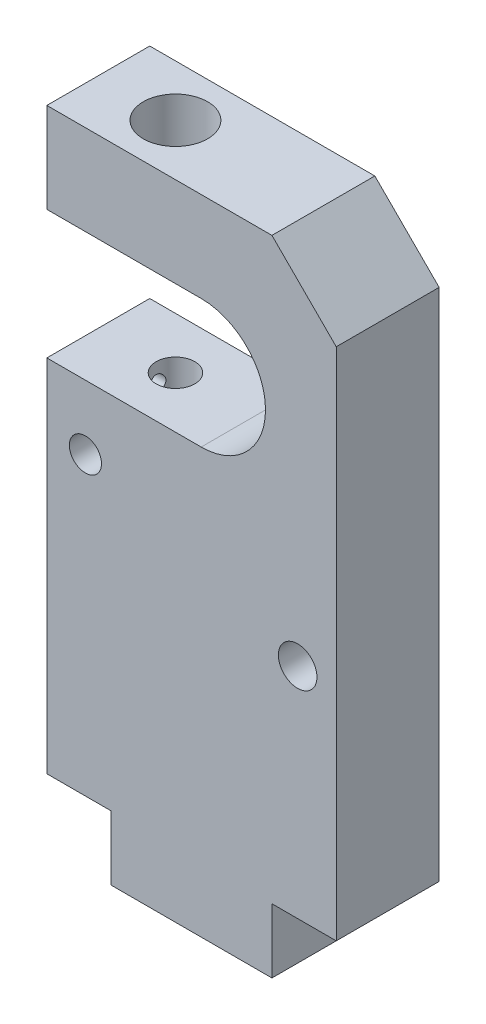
ISO-10303-21;
HEADER;
FILE_DESCRIPTION(('STEP AP214'),'2;1');
FILE_NAME('part.step','',(''),(''),'','','');
FILE_SCHEMA(('AUTOMOTIVE_DESIGN { 1 0 10303 214 1 1 1 1 }'));
ENDSEC;
DATA;
#1=APPLICATION_CONTEXT('core data for automotive mechanical design processes');
#2=APPLICATION_PROTOCOL_DEFINITION('international standard','automotive_design',2000,#1);
#3=PRODUCT_CONTEXT('',#1,'mechanical');
#4=PRODUCT('Part','Part','',(#3));
#5=PRODUCT_RELATED_PRODUCT_CATEGORY('part','',(#4));
#6=PRODUCT_DEFINITION_FORMATION('','',#4);
#7=PRODUCT_DEFINITION_CONTEXT('part definition',#1,'design');
#8=PRODUCT_DEFINITION('design','',#6,#7);
#9=PRODUCT_DEFINITION_SHAPE('','',#8);
#10=(LENGTH_UNIT() NAMED_UNIT(*) SI_UNIT(.MILLI.,.METRE.));
#11=(NAMED_UNIT(*) PLANE_ANGLE_UNIT() SI_UNIT($,.RADIAN.));
#12=(NAMED_UNIT(*) SI_UNIT($,.STERADIAN.) SOLID_ANGLE_UNIT());
#13=UNCERTAINTY_MEASURE_WITH_UNIT(LENGTH_MEASURE(1.E-05),#10,'distance_accuracy_value','');
#14=(GEOMETRIC_REPRESENTATION_CONTEXT(3) GLOBAL_UNCERTAINTY_ASSIGNED_CONTEXT((#13)) GLOBAL_UNIT_ASSIGNED_CONTEXT((#10,
#11,#12)) REPRESENTATION_CONTEXT('',''));
#15=CARTESIAN_POINT('',(0.,0.,0.));
#16=DIRECTION('',(0.,0.,1.));
#17=DIRECTION('',(1.,0.,0.));
#18=AXIS2_PLACEMENT_3D('',#15,#16,#17);
#19=CARTESIAN_POINT('',(1.5,76.,8.));
#20=DIRECTION('',(0.,0.,-1.));
#21=DIRECTION('',(-1.,0.,0.));
#22=AXIS2_PLACEMENT_3D('',#19,#20,#21);
#23=PLANE('',#22);
#24=CARTESIAN_POINT('',(16.5,44.,8.));
#25=DIRECTION('',(0.,0.,1.));
#26=DIRECTION('',(1.,0.,0.));
#27=AXIS2_PLACEMENT_3D('',#24,#25,#26);
#28=CIRCLE('',#27,3.);
#29=CARTESIAN_POINT('',(19.5,44.,8.));
#30=VERTEX_POINT('',#29);
#31=EDGE_CURVE('E194',#30,#30,#28,.T.);
#32=ORIENTED_EDGE('',*,*,#31,.F.);
#33=EDGE_LOOP('',(#32));
#34=FACE_BOUND('',#33,.T.);
#35=DIRECTION('',(1.,0.,0.));
#36=VECTOR('',#35,1.);
#37=CARTESIAN_POINT('',(-12.5,0.,8.));
#38=LINE('',#37,#36);
#39=CARTESIAN_POINT('',(-12.5,0.,8.));
#40=VERTEX_POINT('',#39);
#41=CARTESIAN_POINT('',(12.5,0.,8.));
#42=VERTEX_POINT('',#41);
#43=EDGE_CURVE('E216',#40,#42,#38,.T.);
#44=ORIENTED_EDGE('',*,*,#43,.T.);
#45=DIRECTION('',(0.,1.,0.));
#46=VECTOR('',#45,1.);
#47=CARTESIAN_POINT('',(12.5,0.,8.));
#48=LINE('',#47,#46);
#49=CARTESIAN_POINT('',(12.5,10.,8.));
#50=VERTEX_POINT('',#49);
#51=EDGE_CURVE('E132',#42,#50,#48,.T.);
#52=ORIENTED_EDGE('',*,*,#51,.T.);
#53=DIRECTION('',(1.,0.,0.));
#54=VECTOR('',#53,1.);
#55=CARTESIAN_POINT('',(12.5,10.,8.));
#56=LINE('',#55,#54);
#57=CARTESIAN_POINT('',(22.5,10.,8.));
#58=VERTEX_POINT('',#57);
#59=EDGE_CURVE('E247',#50,#58,#56,.T.);
#60=ORIENTED_EDGE('',*,*,#59,.T.);
#61=DIRECTION('',(0.,1.,0.));
#62=VECTOR('',#61,1.);
#63=CARTESIAN_POINT('',(22.5,10.,8.));
#64=LINE('',#63,#62);
#65=CARTESIAN_POINT('',(22.5,90.,8.));
#66=VERTEX_POINT('',#65);
#67=EDGE_CURVE('E266',#58,#66,#64,.T.);
#68=ORIENTED_EDGE('',*,*,#67,.T.);
#69=DIRECTION('',(-0.707106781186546,0.707106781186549,0.));
#70=VECTOR('',#69,1.);
#71=CARTESIAN_POINT('',(22.5,90.,8.));
#72=LINE('',#71,#70);
#73=CARTESIAN_POINT('',(12.5,100.,8.));
#74=VERTEX_POINT('',#73);
#75=EDGE_CURVE('E263',#66,#74,#72,.T.);
#76=ORIENTED_EDGE('',*,*,#75,.T.);
#77=DIRECTION('',(-1.,0.,0.));
#78=VECTOR('',#77,1.);
#79=CARTESIAN_POINT('',(12.5,100.,8.));
#80=LINE('',#79,#78);
#81=CARTESIAN_POINT('',(-22.5,100.,8.));
#82=VERTEX_POINT('',#81);
#83=EDGE_CURVE('E265',#74,#82,#80,.T.);
#84=ORIENTED_EDGE('',*,*,#83,.T.);
#85=DIRECTION('',(0.,-1.,0.));
#86=VECTOR('',#85,1.);
#87=CARTESIAN_POINT('',(-22.5,100.,8.));
#88=LINE('',#87,#86);
#89=CARTESIAN_POINT('',(-22.5,86.,8.));
#90=VERTEX_POINT('',#89);
#91=EDGE_CURVE('E268',#82,#90,#88,.T.);
#92=ORIENTED_EDGE('',*,*,#91,.T.);
#93=DIRECTION('',(1.,0.,0.));
#94=VECTOR('',#93,1.);
#95=CARTESIAN_POINT('',(-22.5,86.,8.));
#96=LINE('',#95,#94);
#97=CARTESIAN_POINT('',(1.5,86.,8.));
#98=VERTEX_POINT('',#97);
#99=EDGE_CURVE('E274',#90,#98,#96,.T.);
#100=ORIENTED_EDGE('',*,*,#99,.T.);
#101=CARTESIAN_POINT('',(1.5,76.,8.));
#102=DIRECTION('',(0.,0.,-1.));
#103=DIRECTION('',(-1.,0.,0.));
#104=AXIS2_PLACEMENT_3D('',#101,#102,#103);
#105=CIRCLE('',#104,10.);
#106=CARTESIAN_POINT('',(1.5,66.,8.));
#107=VERTEX_POINT('',#106);
#108=EDGE_CURVE('E276',#98,#107,#105,.T.);
#109=ORIENTED_EDGE('',*,*,#108,.T.);
#110=DIRECTION('',(-1.,0.,0.));
#111=VECTOR('',#110,1.);
#112=CARTESIAN_POINT('',(1.5,66.,8.));
#113=LINE('',#112,#111);
#114=CARTESIAN_POINT('',(-22.5,66.,8.));
#115=VERTEX_POINT('',#114);
#116=EDGE_CURVE('E169',#107,#115,#113,.T.);
#117=ORIENTED_EDGE('',*,*,#116,.T.);
#118=DIRECTION('',(0.,-1.,0.));
#119=VECTOR('',#118,1.);
#120=CARTESIAN_POINT('',(-22.5,66.,8.));
#121=LINE('',#120,#119);
#122=CARTESIAN_POINT('',(-22.5,10.,8.));
#123=VERTEX_POINT('',#122);
#124=EDGE_CURVE('E162',#115,#123,#121,.T.);
#125=ORIENTED_EDGE('',*,*,#124,.T.);
#126=DIRECTION('',(1.,0.,0.));
#127=VECTOR('',#126,1.);
#128=CARTESIAN_POINT('',(-22.5,10.,8.));
#129=LINE('',#128,#127);
#130=CARTESIAN_POINT('',(-12.5,10.,8.));
#131=VERTEX_POINT('',#130);
#132=EDGE_CURVE('E166',#123,#131,#129,.T.);
#133=ORIENTED_EDGE('',*,*,#132,.T.);
#134=DIRECTION('',(0.,-1.,0.));
#135=VECTOR('',#134,1.);
#136=CARTESIAN_POINT('',(-12.5,10.,8.));
#137=LINE('',#136,#135);
#138=EDGE_CURVE('E76',#131,#40,#137,.T.);
#139=ORIENTED_EDGE('',*,*,#138,.T.);
#140=EDGE_LOOP('',(#44,#52,#60,#68,#76,#84,#92,#100,#109,#117,#125,#133,#139));
#141=FACE_BOUND('',#140,.T.);
#142=CARTESIAN_POINT('',(-16.5,56.,8.));
#143=DIRECTION('',(0.,0.,1.));
#144=DIRECTION('',(1.,0.,0.));
#145=AXIS2_PLACEMENT_3D('',#142,#143,#144);
#146=CIRCLE('',#145,2.5);
#147=CARTESIAN_POINT('',(-14.,56.,8.));
#148=VERTEX_POINT('',#147);
#149=EDGE_CURVE('E297',#148,#148,#146,.T.);
#150=ORIENTED_EDGE('',*,*,#149,.F.);
#151=EDGE_LOOP('',(#150));
#152=FACE_BOUND('',#151,.T.);
#153=ADVANCED_FACE('F48',(#34,#141,#152),#23,.F.);
#154=CARTESIAN_POINT('',(1.5,76.,-8.));
#155=DIRECTION('',(0.,0.,-1.));
#156=DIRECTION('',(-1.,0.,0.));
#157=AXIS2_PLACEMENT_3D('',#154,#155,#156);
#158=PLANE('',#157);
#159=CARTESIAN_POINT('',(16.5,44.,-8.));
#160=DIRECTION('',(0.,0.,1.));
#161=DIRECTION('',(1.,0.,0.));
#162=AXIS2_PLACEMENT_3D('',#159,#160,#161);
#163=CIRCLE('',#162,3.);
#164=CARTESIAN_POINT('',(19.5,44.,-8.));
#165=VERTEX_POINT('',#164);
#166=EDGE_CURVE('E294',#165,#165,#163,.T.);
#167=ORIENTED_EDGE('',*,*,#166,.T.);
#168=EDGE_LOOP('',(#167));
#169=FACE_BOUND('',#168,.T.);
#170=DIRECTION('',(1.,0.,0.));
#171=VECTOR('',#170,1.);
#172=CARTESIAN_POINT('',(-12.5,0.,-8.));
#173=LINE('',#172,#171);
#174=CARTESIAN_POINT('',(-12.5,0.,-8.));
#175=VERTEX_POINT('',#174);
#176=CARTESIAN_POINT('',(12.5,0.,-8.));
#177=VERTEX_POINT('',#176);
#178=EDGE_CURVE('E190',#175,#177,#173,.T.);
#179=ORIENTED_EDGE('',*,*,#178,.F.);
#180=DIRECTION('',(0.,-1.,0.));
#181=VECTOR('',#180,1.);
#182=CARTESIAN_POINT('',(-12.5,10.,-8.));
#183=LINE('',#182,#181);
#184=CARTESIAN_POINT('',(-12.5,10.,-8.));
#185=VERTEX_POINT('',#184);
#186=EDGE_CURVE('E124',#185,#175,#183,.T.);
#187=ORIENTED_EDGE('',*,*,#186,.F.);
#188=DIRECTION('',(1.,0.,0.));
#189=VECTOR('',#188,1.);
#190=CARTESIAN_POINT('',(-22.5,10.,-8.));
#191=LINE('',#190,#189);
#192=CARTESIAN_POINT('',(-22.5,10.,-8.));
#193=VERTEX_POINT('',#192);
#194=EDGE_CURVE('E213',#193,#185,#191,.T.);
#195=ORIENTED_EDGE('',*,*,#194,.F.);
#196=DIRECTION('',(0.,-1.,0.));
#197=VECTOR('',#196,1.);
#198=CARTESIAN_POINT('',(-22.5,66.,-8.));
#199=LINE('',#198,#197);
#200=CARTESIAN_POINT('',(-22.5,66.,-8.));
#201=VERTEX_POINT('',#200);
#202=EDGE_CURVE('E178',#201,#193,#199,.T.);
#203=ORIENTED_EDGE('',*,*,#202,.F.);
#204=DIRECTION('',(-1.,0.,0.));
#205=VECTOR('',#204,1.);
#206=CARTESIAN_POINT('',(1.5,66.,-8.));
#207=LINE('',#206,#205);
#208=CARTESIAN_POINT('',(1.5,66.,-8.));
#209=VERTEX_POINT('',#208);
#210=EDGE_CURVE('E210',#209,#201,#207,.T.);
#211=ORIENTED_EDGE('',*,*,#210,.F.);
#212=CARTESIAN_POINT('',(1.5,76.,-8.));
#213=DIRECTION('',(0.,0.,-1.));
#214=DIRECTION('',(-1.,0.,0.));
#215=AXIS2_PLACEMENT_3D('',#212,#213,#214);
#216=CIRCLE('',#215,10.);
#217=CARTESIAN_POINT('',(1.5,86.,-8.));
#218=VERTEX_POINT('',#217);
#219=EDGE_CURVE('E208',#218,#209,#216,.T.);
#220=ORIENTED_EDGE('',*,*,#219,.F.);
#221=DIRECTION('',(1.,0.,0.));
#222=VECTOR('',#221,1.);
#223=CARTESIAN_POINT('',(-22.5,86.,-8.));
#224=LINE('',#223,#222);
#225=CARTESIAN_POINT('',(-22.5,86.,-8.));
#226=VERTEX_POINT('',#225);
#227=EDGE_CURVE('E206',#226,#218,#224,.T.);
#228=ORIENTED_EDGE('',*,*,#227,.F.);
#229=DIRECTION('',(0.,-1.,0.));
#230=VECTOR('',#229,1.);
#231=CARTESIAN_POINT('',(-22.5,100.,-8.));
#232=LINE('',#231,#230);
#233=CARTESIAN_POINT('',(-22.5,100.,-8.));
#234=VERTEX_POINT('',#233);
#235=EDGE_CURVE('E204',#234,#226,#232,.T.);
#236=ORIENTED_EDGE('',*,*,#235,.F.);
#237=DIRECTION('',(-1.,0.,0.));
#238=VECTOR('',#237,1.);
#239=CARTESIAN_POINT('',(12.5,100.,-8.));
#240=LINE('',#239,#238);
#241=CARTESIAN_POINT('',(12.5,100.,-8.));
#242=VERTEX_POINT('',#241);
#243=EDGE_CURVE('E202',#242,#234,#240,.T.);
#244=ORIENTED_EDGE('',*,*,#243,.F.);
#245=DIRECTION('',(-0.707106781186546,0.707106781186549,0.));
#246=VECTOR('',#245,1.);
#247=CARTESIAN_POINT('',(22.5,90.,-8.));
#248=LINE('',#247,#246);
#249=CARTESIAN_POINT('',(22.5,90.,-8.));
#250=VERTEX_POINT('',#249);
#251=EDGE_CURVE('E200',#250,#242,#248,.T.);
#252=ORIENTED_EDGE('',*,*,#251,.F.);
#253=DIRECTION('',(0.,1.,0.));
#254=VECTOR('',#253,1.);
#255=CARTESIAN_POINT('',(22.5,10.,-8.));
#256=LINE('',#255,#254);
#257=CARTESIAN_POINT('',(22.5,10.,-8.));
#258=VERTEX_POINT('',#257);
#259=EDGE_CURVE('E198',#258,#250,#256,.T.);
#260=ORIENTED_EDGE('',*,*,#259,.F.);
#261=DIRECTION('',(1.,0.,0.));
#262=VECTOR('',#261,1.);
#263=CARTESIAN_POINT('',(12.5,10.,-8.));
#264=LINE('',#263,#262);
#265=CARTESIAN_POINT('',(12.5,10.,-8.));
#266=VERTEX_POINT('',#265);
#267=EDGE_CURVE('E196',#266,#258,#264,.T.);
#268=ORIENTED_EDGE('',*,*,#267,.F.);
#269=DIRECTION('',(0.,1.,0.));
#270=VECTOR('',#269,1.);
#271=CARTESIAN_POINT('',(12.5,0.,-8.));
#272=LINE('',#271,#270);
#273=EDGE_CURVE('E193',#177,#266,#272,.T.);
#274=ORIENTED_EDGE('',*,*,#273,.F.);
#275=EDGE_LOOP('',(#179,#187,#195,#203,#211,#220,#228,#236,#244,#252,#260,#268,#274));
#276=FACE_BOUND('',#275,.T.);
#277=CARTESIAN_POINT('',(-16.5,56.,-8.));
#278=DIRECTION('',(0.,0.,1.));
#279=DIRECTION('',(1.,0.,0.));
#280=AXIS2_PLACEMENT_3D('',#277,#278,#279);
#281=CIRCLE('',#280,2.5);
#282=CARTESIAN_POINT('',(-14.,56.,-8.));
#283=VERTEX_POINT('',#282);
#284=EDGE_CURVE('E300',#283,#283,#281,.T.);
#285=ORIENTED_EDGE('',*,*,#284,.T.);
#286=EDGE_LOOP('',(#285));
#287=FACE_BOUND('',#286,.T.);
#288=ADVANCED_FACE('F251',(#169,#276,#287),#158,.T.);
#289=CARTESIAN_POINT('',(-12.5,0.,8.));
#290=DIRECTION('',(0.,1.,0.));
#291=DIRECTION('',(0.,0.,1.));
#292=AXIS2_PLACEMENT_3D('',#289,#290,#291);
#293=PLANE('',#292);
#294=CARTESIAN_POINT('',(0.,0.,0.));
#295=DIRECTION('',(0.,-1.,0.));
#296=DIRECTION('',(0.,0.,-1.));
#297=AXIS2_PLACEMENT_3D('',#294,#295,#296);
#298=CIRCLE('',#297,2.5);
#299=CARTESIAN_POINT('',(0.,0.,-2.5));
#300=VERTEX_POINT('',#299);
#301=EDGE_CURVE('E308',#300,#300,#298,.T.);
#302=ORIENTED_EDGE('',*,*,#301,.F.);
#303=EDGE_LOOP('',(#302));
#304=FACE_BOUND('',#303,.T.);
#305=ORIENTED_EDGE('',*,*,#178,.T.);
#306=DIRECTION('',(0.,0.,-1.));
#307=VECTOR('',#306,1.);
#308=CARTESIAN_POINT('',(12.5,0.,8.));
#309=LINE('',#308,#307);
#310=EDGE_CURVE('E13',#42,#177,#309,.T.);
#311=ORIENTED_EDGE('',*,*,#310,.F.);
#312=ORIENTED_EDGE('',*,*,#43,.F.);
#313=DIRECTION('',(0.,0.,-1.));
#314=VECTOR('',#313,1.);
#315=CARTESIAN_POINT('',(-12.5,0.,8.));
#316=LINE('',#315,#314);
#317=EDGE_CURVE('E186',#40,#175,#316,.T.);
#318=ORIENTED_EDGE('',*,*,#317,.T.);
#319=EDGE_LOOP('',(#305,#311,#312,#318));
#320=FACE_BOUND('',#319,.T.);
#321=ADVANCED_FACE('F50',(#304,#320),#293,.F.);
#322=CARTESIAN_POINT('',(12.5,0.,8.));
#323=DIRECTION('',(-1.,0.,0.));
#324=DIRECTION('',(0.,-1.,0.));
#325=AXIS2_PLACEMENT_3D('',#322,#323,#324);
#326=PLANE('',#325);
#327=ORIENTED_EDGE('',*,*,#273,.T.);
#328=DIRECTION('',(0.,0.,-1.));
#329=VECTOR('',#328,1.);
#330=CARTESIAN_POINT('',(12.5,10.,8.));
#331=LINE('',#330,#329);
#332=EDGE_CURVE('E61',#50,#266,#331,.T.);
#333=ORIENTED_EDGE('',*,*,#332,.F.);
#334=ORIENTED_EDGE('',*,*,#51,.F.);
#335=ORIENTED_EDGE('',*,*,#310,.T.);
#336=EDGE_LOOP('',(#327,#333,#334,#335));
#337=FACE_BOUND('',#336,.T.);
#338=ADVANCED_FACE('F402',(#337),#326,.F.);
#339=CARTESIAN_POINT('',(12.5,10.,8.));
#340=DIRECTION('',(0.,1.,0.));
#341=DIRECTION('',(0.,0.,1.));
#342=AXIS2_PLACEMENT_3D('',#339,#340,#341);
#343=PLANE('',#342);
#344=ORIENTED_EDGE('',*,*,#267,.T.);
#345=DIRECTION('',(0.,0.,-1.));
#346=VECTOR('',#345,1.);
#347=CARTESIAN_POINT('',(22.5,10.,8.));
#348=LINE('',#347,#346);
#349=EDGE_CURVE('E238',#58,#258,#348,.T.);
#350=ORIENTED_EDGE('',*,*,#349,.F.);
#351=ORIENTED_EDGE('',*,*,#59,.F.);
#352=ORIENTED_EDGE('',*,*,#332,.T.);
#353=EDGE_LOOP('',(#344,#350,#351,#352));
#354=FACE_BOUND('',#353,.T.);
#355=ADVANCED_FACE('F245',(#354),#343,.F.);
#356=CARTESIAN_POINT('',(22.5,10.,8.));
#357=DIRECTION('',(-1.,0.,0.));
#358=DIRECTION('',(0.,-1.,0.));
#359=AXIS2_PLACEMENT_3D('',#356,#357,#358);
#360=PLANE('',#359);
#361=ORIENTED_EDGE('',*,*,#259,.T.);
#362=DIRECTION('',(0.,0.,-1.));
#363=VECTOR('',#362,1.);
#364=CARTESIAN_POINT('',(22.5,90.,8.));
#365=LINE('',#364,#363);
#366=EDGE_CURVE('E235',#66,#250,#365,.T.);
#367=ORIENTED_EDGE('',*,*,#366,.F.);
#368=ORIENTED_EDGE('',*,*,#67,.F.);
#369=ORIENTED_EDGE('',*,*,#349,.T.);
#370=EDGE_LOOP('',(#361,#367,#368,#369));
#371=FACE_BOUND('',#370,.T.);
#372=ADVANCED_FACE('F257',(#371),#360,.F.);
#373=CARTESIAN_POINT('',(22.5,90.,8.));
#374=DIRECTION('',(-0.707106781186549,-0.707106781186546,0.));
#375=DIRECTION('',(0.707106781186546,-0.707106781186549,0.));
#376=AXIS2_PLACEMENT_3D('',#373,#374,#375);
#377=PLANE('',#376);
#378=ORIENTED_EDGE('',*,*,#251,.T.);
#379=DIRECTION('',(0.,0.,-1.));
#380=VECTOR('',#379,1.);
#381=CARTESIAN_POINT('',(12.5,100.,8.));
#382=LINE('',#381,#380);
#383=EDGE_CURVE('E232',#74,#242,#382,.T.);
#384=ORIENTED_EDGE('',*,*,#383,.F.);
#385=ORIENTED_EDGE('',*,*,#75,.F.);
#386=ORIENTED_EDGE('',*,*,#366,.T.);
#387=EDGE_LOOP('',(#378,#384,#385,#386));
#388=FACE_BOUND('',#387,.T.);
#389=ADVANCED_FACE('F261',(#388),#377,.F.);
#390=CARTESIAN_POINT('',(12.5,100.,8.));
#391=DIRECTION('',(0.,-1.,0.));
#392=DIRECTION('',(0.,0.,-1.));
#393=AXIS2_PLACEMENT_3D('',#390,#391,#392);
#394=PLANE('',#393);
#395=CARTESIAN_POINT('',(-10.5,100.,0.));
#396=DIRECTION('',(0.,1.,0.));
#397=DIRECTION('',(0.,0.,1.));
#398=AXIS2_PLACEMENT_3D('',#395,#396,#397);
#399=CIRCLE('',#398,4.99999999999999);
#400=CARTESIAN_POINT('',(-10.5,100.,4.99999999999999));
#401=VERTEX_POINT('',#400);
#402=EDGE_CURVE('E317',#401,#401,#399,.T.);
#403=ORIENTED_EDGE('',*,*,#402,.F.);
#404=EDGE_LOOP('',(#403));
#405=FACE_BOUND('',#404,.T.);
#406=ORIENTED_EDGE('',*,*,#243,.T.);
#407=DIRECTION('',(0.,0.,-1.));
#408=VECTOR('',#407,1.);
#409=CARTESIAN_POINT('',(-22.5,100.,8.));
#410=LINE('',#409,#408);
#411=EDGE_CURVE('E229',#82,#234,#410,.T.);
#412=ORIENTED_EDGE('',*,*,#411,.F.);
#413=ORIENTED_EDGE('',*,*,#83,.F.);
#414=ORIENTED_EDGE('',*,*,#383,.T.);
#415=EDGE_LOOP('',(#406,#412,#413,#414));
#416=FACE_BOUND('',#415,.T.);
#417=ADVANCED_FACE('F392',(#405,#416),#394,.F.);
#418=CARTESIAN_POINT('',(-22.5,100.,8.));
#419=DIRECTION('',(1.,0.,0.));
#420=DIRECTION('',(0.,0.,-1.));
#421=AXIS2_PLACEMENT_3D('',#418,#419,#420);
#422=PLANE('',#421);
#423=ORIENTED_EDGE('',*,*,#235,.T.);
#424=DIRECTION('',(0.,0.,-1.));
#425=VECTOR('',#424,1.);
#426=CARTESIAN_POINT('',(-22.5,86.,8.));
#427=LINE('',#426,#425);
#428=EDGE_CURVE('E226',#90,#226,#427,.T.);
#429=ORIENTED_EDGE('',*,*,#428,.F.);
#430=ORIENTED_EDGE('',*,*,#91,.F.);
#431=ORIENTED_EDGE('',*,*,#411,.T.);
#432=EDGE_LOOP('',(#423,#429,#430,#431));
#433=FACE_BOUND('',#432,.T.);
#434=ADVANCED_FACE('F388',(#433),#422,.F.);
#435=CARTESIAN_POINT('',(-22.5,86.,8.));
#436=DIRECTION('',(0.,1.,0.));
#437=DIRECTION('',(-1.,0.,0.));
#438=AXIS2_PLACEMENT_3D('',#435,#436,#437);
#439=PLANE('',#438);
#440=CARTESIAN_POINT('',(-10.5,86.,0.));
#441=DIRECTION('',(0.,1.,0.));
#442=DIRECTION('',(-1.,0.,0.));
#443=AXIS2_PLACEMENT_3D('',#440,#441,#442);
#444=CIRCLE('',#443,4.99999999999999);
#445=CARTESIAN_POINT('',(-15.5,86.,0.));
#446=VERTEX_POINT('',#445);
#447=EDGE_CURVE('E314',#446,#446,#444,.T.);
#448=ORIENTED_EDGE('',*,*,#447,.T.);
#449=EDGE_LOOP('',(#448));
#450=FACE_BOUND('',#449,.T.);
#451=ORIENTED_EDGE('',*,*,#227,.T.);
#452=DIRECTION('',(0.,0.,-1.));
#453=VECTOR('',#452,1.);
#454=CARTESIAN_POINT('',(1.5,86.,8.));
#455=LINE('',#454,#453);
#456=EDGE_CURVE('E223',#98,#218,#455,.T.);
#457=ORIENTED_EDGE('',*,*,#456,.F.);
#458=ORIENTED_EDGE('',*,*,#99,.F.);
#459=ORIENTED_EDGE('',*,*,#428,.T.);
#460=EDGE_LOOP('',(#451,#457,#458,#459));
#461=FACE_BOUND('',#460,.T.);
#462=ADVANCED_FACE('F385',(#450,#461),#439,.F.);
#463=CARTESIAN_POINT('',(1.5,76.,8.));
#464=DIRECTION('',(0.,0.,-1.));
#465=DIRECTION('',(-1.,0.,0.));
#466=AXIS2_PLACEMENT_3D('',#463,#464,#465);
#467=CYLINDRICAL_SURFACE('',#466,10.);
#468=ORIENTED_EDGE('',*,*,#219,.T.);
#469=DIRECTION('',(0.,0.,-1.));
#470=VECTOR('',#469,1.);
#471=CARTESIAN_POINT('',(1.5,66.,8.));
#472=LINE('',#471,#470);
#473=EDGE_CURVE('E220',#107,#209,#472,.T.);
#474=ORIENTED_EDGE('',*,*,#473,.F.);
#475=ORIENTED_EDGE('',*,*,#108,.F.);
#476=ORIENTED_EDGE('',*,*,#456,.T.);
#477=EDGE_LOOP('',(#468,#474,#475,#476));
#478=FACE_BOUND('',#477,.T.);
#479=ADVANCED_FACE('F282',(#478),#467,.F.);
#480=CARTESIAN_POINT('',(1.5,66.,8.));
#481=DIRECTION('',(0.,-1.,0.));
#482=DIRECTION('',(1.,0.,0.));
#483=AXIS2_PLACEMENT_3D('',#480,#481,#482);
#484=PLANE('',#483);
#485=CARTESIAN_POINT('',(-10.5,66.,0.));
#486=DIRECTION('',(0.,1.,0.));
#487=DIRECTION('',(0.,0.,1.));
#488=AXIS2_PLACEMENT_3D('',#485,#486,#487);
#489=CIRCLE('',#488,3.);
#490=CARTESIAN_POINT('',(-10.5,66.,3.));
#491=VERTEX_POINT('',#490);
#492=EDGE_CURVE('E329',#491,#491,#489,.T.);
#493=ORIENTED_EDGE('',*,*,#492,.F.);
#494=EDGE_LOOP('',(#493));
#495=FACE_BOUND('',#494,.T.);
#496=ORIENTED_EDGE('',*,*,#210,.T.);
#497=DIRECTION('',(0.,0.,-1.));
#498=VECTOR('',#497,1.);
#499=CARTESIAN_POINT('',(-22.5,66.,8.));
#500=LINE('',#499,#498);
#501=EDGE_CURVE('E181',#115,#201,#500,.T.);
#502=ORIENTED_EDGE('',*,*,#501,.F.);
#503=ORIENTED_EDGE('',*,*,#116,.F.);
#504=ORIENTED_EDGE('',*,*,#473,.T.);
#505=EDGE_LOOP('',(#496,#502,#503,#504));
#506=FACE_BOUND('',#505,.T.);
#507=ADVANCED_FACE('F286',(#495,#506),#484,.F.);
#508=CARTESIAN_POINT('',(-22.5,66.,8.));
#509=DIRECTION('',(1.,0.,0.));
#510=DIRECTION('',(0.,1.,0.));
#511=AXIS2_PLACEMENT_3D('',#508,#509,#510);
#512=PLANE('',#511);
#513=CARTESIAN_POINT('',(-22.5,24.,0.));
#514=DIRECTION('',(1.,0.,0.));
#515=DIRECTION('',(0.,-1.,0.));
#516=AXIS2_PLACEMENT_3D('',#513,#514,#515);
#517=ELLIPSE('',#516,4.,2.00000000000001);
#518=CARTESIAN_POINT('',(-22.5,20.,0.));
#519=VERTEX_POINT('',#518);
#520=EDGE_CURVE('E332',#519,#519,#517,.F.);
#521=ORIENTED_EDGE('',*,*,#520,.F.);
#522=EDGE_LOOP('',(#521));
#523=FACE_BOUND('',#522,.T.);
#524=CARTESIAN_POINT('',(-22.5,63.,0.));
#525=DIRECTION('',(-1.,0.,0.));
#526=DIRECTION('',(0.,0.,1.));
#527=AXIS2_PLACEMENT_3D('',#524,#525,#526);
#528=CIRCLE('',#527,1.25);
#529=CARTESIAN_POINT('',(-22.5,63.,1.25));
#530=VERTEX_POINT('',#529);
#531=EDGE_CURVE('E311',#530,#530,#528,.T.);
#532=ORIENTED_EDGE('',*,*,#531,.F.);
#533=EDGE_LOOP('',(#532));
#534=FACE_BOUND('',#533,.T.);
#535=ORIENTED_EDGE('',*,*,#202,.T.);
#536=DIRECTION('',(0.,0.,-1.));
#537=VECTOR('',#536,1.);
#538=CARTESIAN_POINT('',(-22.5,10.,8.));
#539=LINE('',#538,#537);
#540=EDGE_CURVE('E175',#123,#193,#539,.T.);
#541=ORIENTED_EDGE('',*,*,#540,.F.);
#542=ORIENTED_EDGE('',*,*,#124,.F.);
#543=ORIENTED_EDGE('',*,*,#501,.T.);
#544=EDGE_LOOP('',(#535,#541,#542,#543));
#545=FACE_BOUND('',#544,.T.);
#546=ADVANCED_FACE('F176',(#523,#534,#545),#512,.F.);
#547=CARTESIAN_POINT('',(-22.5,10.,8.));
#548=DIRECTION('',(0.,1.,0.));
#549=DIRECTION('',(0.,0.,1.));
#550=AXIS2_PLACEMENT_3D('',#547,#548,#549);
#551=PLANE('',#550);
#552=ORIENTED_EDGE('',*,*,#194,.T.);
#553=DIRECTION('',(0.,0.,-1.));
#554=VECTOR('',#553,1.);
#555=CARTESIAN_POINT('',(-12.5,10.,8.));
#556=LINE('',#555,#554);
#557=EDGE_CURVE('E182',#131,#185,#556,.T.);
#558=ORIENTED_EDGE('',*,*,#557,.F.);
#559=ORIENTED_EDGE('',*,*,#132,.F.);
#560=ORIENTED_EDGE('',*,*,#540,.T.);
#561=EDGE_LOOP('',(#552,#558,#559,#560));
#562=FACE_BOUND('',#561,.T.);
#563=ADVANCED_FACE('F184',(#562),#551,.F.);
#564=CARTESIAN_POINT('',(-12.5,10.,8.));
#565=DIRECTION('',(1.,0.,0.));
#566=DIRECTION('',(0.,1.,0.));
#567=AXIS2_PLACEMENT_3D('',#564,#565,#566);
#568=PLANE('',#567);
#569=ORIENTED_EDGE('',*,*,#186,.T.);
#570=ORIENTED_EDGE('',*,*,#317,.F.);
#571=ORIENTED_EDGE('',*,*,#138,.F.);
#572=ORIENTED_EDGE('',*,*,#557,.T.);
#573=EDGE_LOOP('',(#569,#570,#571,#572));
#574=FACE_BOUND('',#573,.T.);
#575=ADVANCED_FACE('F287',(#574),#568,.F.);
#576=CARTESIAN_POINT('',(16.5,44.,8.));
#577=DIRECTION('',(0.,0.,-1.));
#578=DIRECTION('',(-1.,0.,0.));
#579=AXIS2_PLACEMENT_3D('',#576,#577,#578);
#580=CYLINDRICAL_SURFACE('',#579,3.);
#581=ORIENTED_EDGE('',*,*,#31,.T.);
#582=EDGE_LOOP('',(#581));
#583=FACE_BOUND('',#582,.T.);
#584=ORIENTED_EDGE('',*,*,#166,.F.);
#585=EDGE_LOOP('',(#584));
#586=FACE_BOUND('',#585,.T.);
#587=ADVANCED_FACE('F373',(#583,#586),#580,.F.);
#588=CARTESIAN_POINT('',(-16.5,56.,8.));
#589=DIRECTION('',(0.,0.,-1.));
#590=DIRECTION('',(-1.,0.,0.));
#591=AXIS2_PLACEMENT_3D('',#588,#589,#590);
#592=CYLINDRICAL_SURFACE('',#591,2.5);
#593=ORIENTED_EDGE('',*,*,#149,.T.);
#594=EDGE_LOOP('',(#593));
#595=FACE_BOUND('',#594,.T.);
#596=ORIENTED_EDGE('',*,*,#284,.F.);
#597=EDGE_LOOP('',(#596));
#598=FACE_BOUND('',#597,.T.);
#599=ADVANCED_FACE('F471',(#595,#598),#592,.F.);
#600=CARTESIAN_POINT('',(0.,20.,0.));
#601=DIRECTION('',(0.,-1.,0.));
#602=DIRECTION('',(0.,0.,-1.));
#603=AXIS2_PLACEMENT_3D('',#600,#601,#602);
#604=CONICAL_SURFACE('',#603,2.5,1.02974425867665);
#605=CARTESIAN_POINT('',(0.,21.5021515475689,0.));
#606=VERTEX_POINT('',#605);
#607=VERTEX_LOOP('',#606);
#608=FACE_BOUND('',#607,.T.);
#609=CARTESIAN_POINT('',(0.,20.,0.));
#610=DIRECTION('',(0.,-1.,0.));
#611=DIRECTION('',(0.,0.,-1.));
#612=AXIS2_PLACEMENT_3D('',#609,#610,#611);
#613=CIRCLE('',#612,2.5);
#614=CARTESIAN_POINT('',(0.,20.,-2.5));
#615=VERTEX_POINT('',#614);
#616=EDGE_CURVE('E303',#615,#615,#613,.T.);
#617=ORIENTED_EDGE('',*,*,#616,.T.);
#618=EDGE_LOOP('',(#617));
#619=FACE_BOUND('',#618,.T.);
#620=ADVANCED_FACE('F358',(#608,#619),#604,.F.);
#621=CARTESIAN_POINT('',(0.,0.,0.));
#622=DIRECTION('',(0.,-1.,0.));
#623=DIRECTION('',(0.,0.,-1.));
#624=AXIS2_PLACEMENT_3D('',#621,#622,#623);
#625=CYLINDRICAL_SURFACE('',#624,2.5);
#626=ORIENTED_EDGE('',*,*,#616,.F.);
#627=EDGE_LOOP('',(#626));
#628=FACE_BOUND('',#627,.T.);
#629=ORIENTED_EDGE('',*,*,#301,.T.);
#630=EDGE_LOOP('',(#629));
#631=FACE_BOUND('',#630,.T.);
#632=ADVANCED_FACE('F349',(#628,#631),#625,.F.);
#633=CARTESIAN_POINT('',(-22.5,63.,0.));
#634=DIRECTION('',(-1.,0.,0.));
#635=DIRECTION('',(0.,0.,1.));
#636=AXIS2_PLACEMENT_3D('',#633,#634,#635);
#637=CYLINDRICAL_SURFACE('',#636,1.25);
#638=CARTESIAN_POINT('',(-13.227178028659,63.,1.25));
#639=CARTESIAN_POINT('',(-13.2271851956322,62.9333281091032,1.24999259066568));
#640=CARTESIAN_POINT('',(-13.229658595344,62.8665473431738,1.24463203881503));
#641=CARTESIAN_POINT('',(-13.2392383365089,62.7349130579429,1.22339678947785));
#642=CARTESIAN_POINT('',(-13.2463572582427,62.6700652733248,1.20749354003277));
#643=CARTESIAN_POINT('',(-13.2642691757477,62.5444388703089,1.16589988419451));
#644=CARTESIAN_POINT('',(-13.2750471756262,62.483644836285,1.14024937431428));
#645=CARTESIAN_POINT('',(-13.299041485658,62.3672405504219,1.08000637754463));
#646=CARTESIAN_POINT('',(-13.3122572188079,62.3116290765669,1.04541600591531));
#647=CARTESIAN_POINT('',(-13.3405576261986,62.2036742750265,0.965973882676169));
#648=CARTESIAN_POINT('',(-13.3557056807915,62.1516924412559,0.920653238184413));
#649=CARTESIAN_POINT('',(-13.3856429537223,62.0557997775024,0.822021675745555));
#650=CARTESIAN_POINT('',(-13.4004320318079,62.011892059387,0.768707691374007));
#651=CARTESIAN_POINT('',(-13.4287553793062,61.9315504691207,0.652763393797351));
#652=CARTESIAN_POINT('',(-13.4422073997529,61.8955233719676,0.589829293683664));
#653=CARTESIAN_POINT('',(-13.4655651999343,61.8347239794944,0.458132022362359));
#654=CARTESIAN_POINT('',(-13.4754725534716,61.8099466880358,0.38937145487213));
#655=CARTESIAN_POINT('',(-13.4901752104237,61.7736605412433,0.251768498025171));
#656=CARTESIAN_POINT('',(-13.4952097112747,61.761528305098,0.183116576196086));
#657=CARTESIAN_POINT('',(-13.5004682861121,61.7488623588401,0.0445791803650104));
#658=CARTESIAN_POINT('',(-13.5006943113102,61.748323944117,-0.0253057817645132));
#659=CARTESIAN_POINT('',(-13.4964512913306,61.7585342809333,-0.159792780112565));
#660=CARTESIAN_POINT('',(-13.4922671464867,61.7685981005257,-0.22445748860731));
#661=CARTESIAN_POINT('',(-13.4800651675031,61.7985531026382,-0.351082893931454));
#662=CARTESIAN_POINT('',(-13.4720470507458,61.8184450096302,-0.413043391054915));
#663=CARTESIAN_POINT('',(-13.4527985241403,61.8677280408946,-0.533638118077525));
#664=CARTESIAN_POINT('',(-13.4415209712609,61.8972594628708,-0.592207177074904));
#665=CARTESIAN_POINT('',(-13.4168571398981,61.9648457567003,-0.70371176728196));
#666=CARTESIAN_POINT('',(-13.4034701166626,62.002903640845,-0.756645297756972));
#667=CARTESIAN_POINT('',(-13.3748169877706,62.0895824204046,-0.859340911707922));
#668=CARTESIAN_POINT('',(-13.3594849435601,62.138758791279,-0.908616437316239));
#669=CARTESIAN_POINT('',(-13.3293786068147,62.2447114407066,-0.998431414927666));
#670=CARTESIAN_POINT('',(-13.3146045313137,62.3014906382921,-1.03896749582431));
#671=CARTESIAN_POINT('',(-13.2868161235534,62.4233950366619,-1.11140189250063));
#672=CARTESIAN_POINT('',(-13.2738755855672,62.4887332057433,-1.1429725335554));
#673=CARTESIAN_POINT('',(-13.2520984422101,62.6244810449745,-1.19446432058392));
#674=CARTESIAN_POINT('',(-13.243258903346,62.6948870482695,-1.21439379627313));
#675=CARTESIAN_POINT('',(-13.2314121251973,62.833896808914,-1.24080025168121));
#676=CARTESIAN_POINT('',(-13.2280636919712,62.902321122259,-1.24806614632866));
#677=CARTESIAN_POINT('',(-13.2266028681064,63.0394784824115,-1.25125630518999));
#678=CARTESIAN_POINT('',(-13.2284886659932,63.1082114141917,-1.24718449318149));
#679=CARTESIAN_POINT('',(-13.2369313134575,63.2393983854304,-1.22853477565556));
#680=CARTESIAN_POINT('',(-13.2431813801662,63.3019726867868,-1.21464618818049));
#681=CARTESIAN_POINT('',(-13.2592563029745,63.4238512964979,-1.17767058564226));
#682=CARTESIAN_POINT('',(-13.2690819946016,63.4831548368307,-1.15458142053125));
#683=CARTESIAN_POINT('',(-13.29170797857,63.5996153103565,-1.09877520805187));
#684=CARTESIAN_POINT('',(-13.3046166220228,63.6565749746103,-1.06569183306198));
#685=CARTESIAN_POINT('',(-13.331800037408,63.764408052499,-0.99120078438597));
#686=CARTESIAN_POINT('',(-13.3460753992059,63.8152788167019,-0.94978950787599));
#687=CARTESIAN_POINT('',(-13.3757861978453,63.913800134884,-0.855844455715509));
#688=CARTESIAN_POINT('',(-13.3912214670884,63.9608513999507,-0.802679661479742));
#689=CARTESIAN_POINT('',(-13.4204336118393,64.0454722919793,-0.688851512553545));
#690=CARTESIAN_POINT('',(-13.4342103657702,64.0830412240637,-0.628187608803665));
#691=CARTESIAN_POINT('',(-13.4586425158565,64.1475898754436,-0.500654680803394));
#692=CARTESIAN_POINT('',(-13.4692898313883,64.1745422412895,-0.433770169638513));
#693=CARTESIAN_POINT('',(-13.4861817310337,64.2166167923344,-0.29585883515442));
#694=CARTESIAN_POINT('',(-13.4924289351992,64.2317460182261,-0.224834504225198));
#695=CARTESIAN_POINT('',(-13.4995153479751,64.2488581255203,-0.0860165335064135));
#696=CARTESIAN_POINT('',(-13.5007020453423,64.251685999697,-0.0183440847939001));
#697=CARTESIAN_POINT('',(-13.4984952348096,64.2463868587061,0.116486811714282));
#698=CARTESIAN_POINT('',(-13.4951025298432,64.2382617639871,0.183645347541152));
#699=CARTESIAN_POINT('',(-13.4843006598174,64.2118939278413,0.313086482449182));
#700=CARTESIAN_POINT('',(-13.4770382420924,64.1940203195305,0.375457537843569));
#701=CARTESIAN_POINT('',(-13.4592949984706,64.1490657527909,0.49629223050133));
#702=CARTESIAN_POINT('',(-13.4488135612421,64.1219830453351,0.554755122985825));
#703=CARTESIAN_POINT('',(-13.4250582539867,64.0580104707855,0.669024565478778));
#704=CARTESIAN_POINT('',(-13.4116795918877,64.020732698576,0.724591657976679));
#705=CARTESIAN_POINT('',(-13.3837156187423,63.9379928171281,0.828918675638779));
#706=CARTESIAN_POINT('',(-13.369129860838,63.8925276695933,0.87767606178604));
#707=CARTESIAN_POINT('',(-13.3391484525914,63.7910551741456,0.970449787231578));
#708=CARTESIAN_POINT('',(-13.323765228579,63.7345409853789,1.01391775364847));
#709=CARTESIAN_POINT('',(-13.2949555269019,63.6145412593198,1.09083332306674));
#710=CARTESIAN_POINT('',(-13.2815301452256,63.5510518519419,1.12427532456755));
#711=CARTESIAN_POINT('',(-13.2584255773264,63.4190561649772,1.17982766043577));
#712=CARTESIAN_POINT('',(-13.2487265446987,63.3505788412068,1.20199823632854));
#713=CARTESIAN_POINT('',(-13.2344080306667,63.2104604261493,1.23423556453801));
#714=CARTESIAN_POINT('',(-13.2297715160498,63.1388307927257,1.2443429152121));
#715=CARTESIAN_POINT('',(-13.2274497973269,63.0446414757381,1.2494046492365));
#716=CARTESIAN_POINT('',(-13.2271756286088,63.022326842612,1.25000248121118));
#717=CARTESIAN_POINT('',(-13.227178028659,63.,1.25));
#718=B_SPLINE_CURVE_WITH_KNOTS('',3,(#638,#639,#640,#641,#642,#643,#644,#645,#646,#647,#648,
#649,#650,#651,#652,#653,#654,#655,#656,#657,#658,#659,#660,#661,#662,#663,#664,#665,#666,#667,
#668,#669,#670,#671,#672,#673,#674,#675,#676,#677,#678,#679,#680,#681,#682,#683,#684,#685,#686,
#687,#688,#689,#690,#691,#692,#693,#694,#695,#696,#697,#698,#699,#700,#701,#702,#703,#704,#705,
#706,#707,#708,#709,#710,#711,#712,#713,#714,#715,#716,#717),.UNSPECIFIED.,.T.,.F.,(4,2,2,2,2,2,
2,2,2,2,2,2,2,2,2,2,2,2,2,2,2,2,2,2,2,2,2,2,2,2,2,2,2,2,2,2,2,2,2,4),(0.,0.199951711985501,
0.400447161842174,0.600130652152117,0.799766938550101,1.01066841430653,1.2216510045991,
1.44178476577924,1.66182066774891,1.87040605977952,2.0789068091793,2.27471840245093,
2.47054443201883,2.66935814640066,2.86824221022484,3.08114531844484,3.29413040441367,
3.51411545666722,3.73394290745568,3.93950778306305,4.14500152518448,4.33733901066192,
4.52972146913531,4.7302512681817,4.93086800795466,5.14781662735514,5.36478114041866,
5.58230105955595,5.79969134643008,6.00188635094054,6.20404590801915,6.39903415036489,
6.59405944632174,6.79789862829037,7.00181361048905,7.21960426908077,7.4375163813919,
7.65425125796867,7.87025464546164,7.93721375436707),.UNSPECIFIED.);
#719=CARTESIAN_POINT('',(-13.227178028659,63.,1.25));
#720=VERTEX_POINT('',#719);
#721=EDGE_CURVE('E52',#720,#720,#718,.T.);
#722=ORIENTED_EDGE('',*,*,#721,.T.);
#723=EDGE_LOOP('',(#722));
#724=FACE_BOUND('',#723,.T.);
#725=ORIENTED_EDGE('',*,*,#531,.T.);
#726=EDGE_LOOP('',(#725));
#727=FACE_BOUND('',#726,.T.);
#728=ADVANCED_FACE('F346',(#724,#727),#637,.F.);
#729=CARTESIAN_POINT('',(-10.5,100.,0.));
#730=DIRECTION('',(0.,1.,0.));
#731=DIRECTION('',(0.,0.,1.));
#732=AXIS2_PLACEMENT_3D('',#729,#730,#731);
#733=CYLINDRICAL_SURFACE('',#732,4.99999999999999);
#734=ORIENTED_EDGE('',*,*,#447,.F.);
#735=EDGE_LOOP('',(#734));
#736=FACE_BOUND('',#735,.T.);
#737=ORIENTED_EDGE('',*,*,#402,.T.);
#738=EDGE_LOOP('',(#737));
#739=FACE_BOUND('',#738,.T.);
#740=ADVANCED_FACE('F348',(#736,#739),#733,.F.);
#741=CARTESIAN_POINT('',(-10.5,66.,0.));
#742=DIRECTION('',(0.,1.,0.));
#743=DIRECTION('',(0.,0.,1.));
#744=AXIS2_PLACEMENT_3D('',#741,#742,#743);
#745=CYLINDRICAL_SURFACE('',#744,3.);
#746=ORIENTED_EDGE('',*,*,#492,.T.);
#747=EDGE_LOOP('',(#746));
#748=FACE_BOUND('',#747,.T.);
#749=CARTESIAN_POINT('',(-10.5,60.,0.));
#750=DIRECTION('',(0.,1.,0.));
#751=DIRECTION('',(0.,0.,1.));
#752=AXIS2_PLACEMENT_3D('',#749,#750,#751);
#753=CIRCLE('',#752,3.);
#754=CARTESIAN_POINT('',(-10.5,60.,3.));
#755=VERTEX_POINT('',#754);
#756=EDGE_CURVE('E326',#755,#755,#753,.T.);
#757=ORIENTED_EDGE('',*,*,#756,.F.);
#758=EDGE_LOOP('',(#757));
#759=FACE_BOUND('',#758,.T.);
#760=ORIENTED_EDGE('',*,*,#721,.F.);
#761=EDGE_LOOP('',(#760));
#762=FACE_BOUND('',#761,.T.);
#763=ADVANCED_FACE('F355',(#748,#759,#762),#745,.F.);
#764=CARTESIAN_POINT('',(-10.5,36.,0.));
#765=DIRECTION('',(0.,1.,0.));
#766=DIRECTION('',(0.,0.,1.));
#767=AXIS2_PLACEMENT_3D('',#764,#765,#766);
#768=CONICAL_SURFACE('',#767,2.,1.02974425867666);
#769=CARTESIAN_POINT('',(-10.5,34.7982787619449,0.));
#770=VERTEX_POINT('',#769);
#771=VERTEX_LOOP('',#770);
#772=FACE_BOUND('',#771,.T.);
#773=CARTESIAN_POINT('',(-10.5,36.,0.));
#774=DIRECTION('',(0.,1.,0.));
#775=DIRECTION('',(0.,0.,1.));
#776=AXIS2_PLACEMENT_3D('',#773,#774,#775);
#777=CIRCLE('',#776,2.);
#778=CARTESIAN_POINT('',(-10.5,36.,2.));
#779=VERTEX_POINT('',#778);
#780=EDGE_CURVE('E320',#779,#779,#777,.T.);
#781=ORIENTED_EDGE('',*,*,#780,.T.);
#782=EDGE_LOOP('',(#781));
#783=FACE_BOUND('',#782,.T.);
#784=ADVANCED_FACE('F506',(#772,#783),#768,.F.);
#785=CARTESIAN_POINT('',(-10.5,66.,0.));
#786=DIRECTION('',(0.,1.,0.));
#787=DIRECTION('',(0.,0.,1.));
#788=AXIS2_PLACEMENT_3D('',#785,#786,#787);
#789=CYLINDRICAL_SURFACE('',#788,2.);
#790=CARTESIAN_POINT('',(-10.5,44.7846096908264,0.));
#791=DIRECTION('',(-0.258819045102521,-0.965925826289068,0.));
#792=DIRECTION('',(-0.965925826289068,0.258819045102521,0.));
#793=AXIS2_PLACEMENT_3D('',#790,#791,#792);
#794=ELLIPSE('',#793,2.07055236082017,2.);
#795=CARTESIAN_POINT('',(-10.5,44.7846096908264,-2.));
#796=VERTEX_POINT('',#795);
#797=CARTESIAN_POINT('',(-10.5,44.7846096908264,2.));
#798=VERTEX_POINT('',#797);
#799=EDGE_CURVE('E333',#796,#798,#794,.F.);
#800=ORIENTED_EDGE('',*,*,#799,.F.);
#801=CARTESIAN_POINT('',(-10.5,44.7846096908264,0.));
#802=DIRECTION('',(-0.965925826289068,0.258819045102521,0.));
#803=DIRECTION('',(-0.258819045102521,-0.965925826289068,0.));
#804=AXIS2_PLACEMENT_3D('',#801,#802,#803);
#805=ELLIPSE('',#804,7.72740661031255,2.);
#806=EDGE_CURVE('E67',#798,#796,#805,.F.);
#807=ORIENTED_EDGE('',*,*,#806,.F.);
#808=EDGE_LOOP('',(#800,#807));
#809=FACE_BOUND('',#808,.T.);
#810=ORIENTED_EDGE('',*,*,#780,.F.);
#811=EDGE_LOOP('',(#810));
#812=FACE_BOUND('',#811,.T.);
#813=CARTESIAN_POINT('',(-10.5,60.,0.));
#814=DIRECTION('',(0.,1.,0.));
#815=DIRECTION('',(0.,0.,1.));
#816=AXIS2_PLACEMENT_3D('',#813,#814,#815);
#817=CIRCLE('',#816,2.);
#818=CARTESIAN_POINT('',(-10.5,60.,2.));
#819=VERTEX_POINT('',#818);
#820=EDGE_CURVE('E323',#819,#819,#817,.T.);
#821=ORIENTED_EDGE('',*,*,#820,.T.);
#822=EDGE_LOOP('',(#821));
#823=FACE_BOUND('',#822,.T.);
#824=ADVANCED_FACE('F513',(#809,#812,#823),#789,.F.);
#825=CARTESIAN_POINT('',(-8.50000000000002,60.,0.));
#826=DIRECTION('',(0.,-1.,0.));
#827=DIRECTION('',(0.,0.,-1.));
#828=AXIS2_PLACEMENT_3D('',#825,#826,#827);
#829=PLANE('',#828);
#830=ORIENTED_EDGE('',*,*,#820,.F.);
#831=EDGE_LOOP('',(#830));
#832=FACE_BOUND('',#831,.T.);
#833=ORIENTED_EDGE('',*,*,#756,.T.);
#834=EDGE_LOOP('',(#833));
#835=FACE_BOUND('',#834,.T.);
#836=ADVANCED_FACE('F521',(#832,#835),#829,.F.);
#837=CARTESIAN_POINT('',(21.6596483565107,100.486754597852,0.));
#838=DIRECTION('',(-0.500000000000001,-0.866025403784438,0.));
#839=DIRECTION('',(0.866025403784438,-0.500000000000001,0.));
#840=AXIS2_PLACEMENT_3D('',#837,#838,#839);
#841=CYLINDRICAL_SURFACE('',#840,2.00000000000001);
#842=ORIENTED_EDGE('',*,*,#806,.T.);
#843=ORIENTED_EDGE('',*,*,#799,.T.);
#844=EDGE_LOOP('',(#842,#843));
#845=FACE_BOUND('',#844,.T.);
#846=ORIENTED_EDGE('',*,*,#520,.T.);
#847=EDGE_LOOP('',(#846));
#848=FACE_BOUND('',#847,.T.);
#849=ADVANCED_FACE('F339',(#845,#848),#841,.F.);
#850=CLOSED_SHELL('',(#153,#288,#321,#338,#355,#372,#389,#417,#434,#462,#479,#507,#546,#563,
#575,#587,#599,#620,#632,#728,#740,#763,#784,#824,#836,#849));
#851=MANIFOLD_SOLID_BREP('B2',#850);
#852=ADVANCED_BREP_SHAPE_REPRESENTATION('',(#18,#851),#14);
#853=SHAPE_DEFINITION_REPRESENTATION(#9,#852);
ENDSEC;
END-ISO-10303-21;
